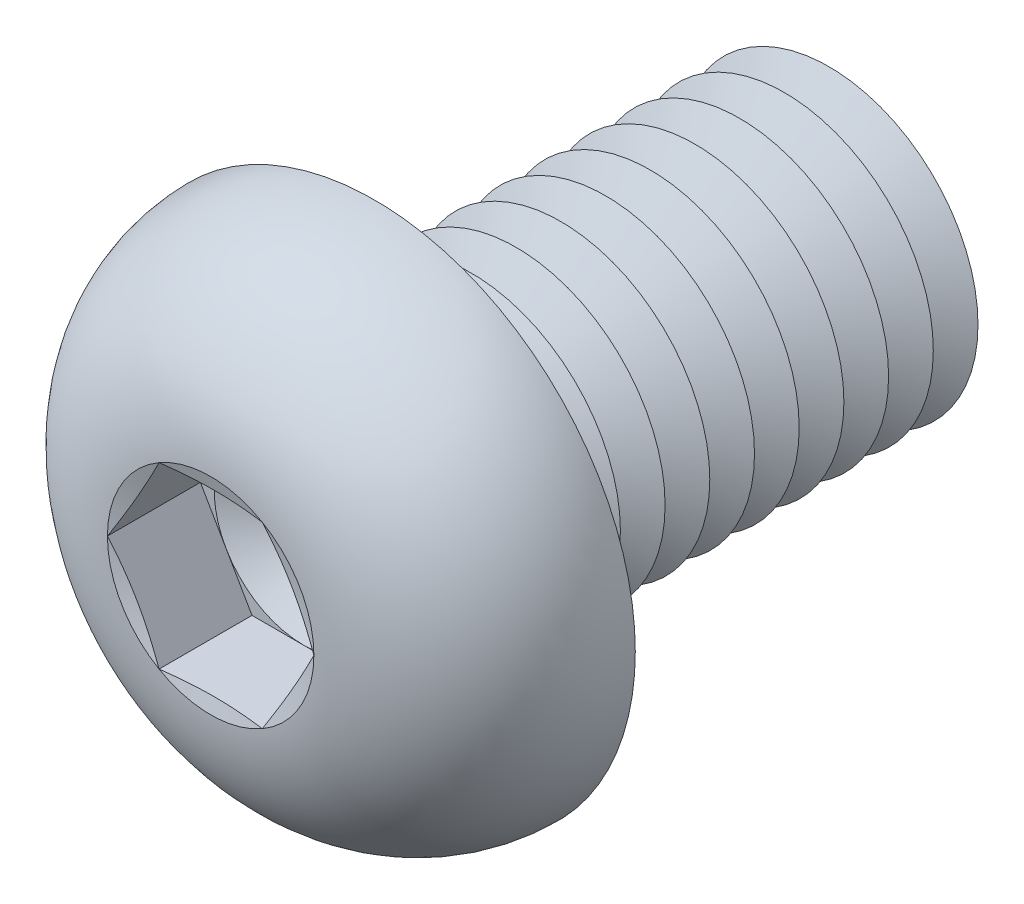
from build123d import *

# Parameters (mm, degrees)
FILLET1_R          = 0.75
LPATTERN1_COUNT    = 10
LPATTERN1_PITCH    = 1.5
CUT_EXTRUDE1_DEPTH = 3.12


with BuildPart() as part:
    # Sketch1 → Revolve1 (revolve)
    with BuildSketch(Plane(origin=(0, 0, 0), x_dir=(0, 0, -1), z_dir=(1, 0, 0)), mode=Mode.PRIVATE) as revolve1_sk:
        with BuildLine():
            Line((0, 5), (0, 8.75))
            ThreePointArc((0, 8.75), (-3.814142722, 7.21429474), (-5.5, 3.4641))
            Line((-5.5, 3.4641), (-5.035898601, 1.73205))
            Line((-5.035898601, 1.73205), (-5.5, 1.73205))
            Line((-5.5, 1.73205), (-5.5, 0))
            Line((-5.5, 0), (16, 0))
            Line((16, 0), (16, 5))
            Line((16, 5), (0, 5))
        make_face()
    revolve(revolve1_sk.sketch.rotate(Axis((0, 0, -16), (0, 0, 1)), 90), axis=Axis((0, 0, -16), (0, 0, 1)))

    # Fillet1
    fillet1_edges = [part.edges().sort_by_distance(p)[0] for p in [
        (5, 0, 0),
    ]]
    fillet(fillet1_edges, radius=FILLET1_R)

    # Sketch2 → Cut-Revolve1 (revolve, cut)
    with BuildSketch(Plane(origin=(0, 0, 0), x_dir=(0, 0, -1), z_dir=(1, 0, 0)), mode=Mode.PRIVATE) as cut_revolve1_sk:
        Polygon((15.25, 5), (16.75, 5), (16, 3.700961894), align=None)
    cut_revolve1 = revolve(cut_revolve1_sk.sketch.rotate(Axis((0, 0, -16), (0, 0, -1)), 270), axis=Axis((0, 0, -16), (0, 0, -1)), mode=Mode.SUBTRACT)

    # LPattern1: Cut-Revolve1 ×10
    with Locations(*[(0, 0, i * LPATTERN1_PITCH) for i in range(1, LPATTERN1_COUNT)]):
        add(cut_revolve1, mode=Mode.SUBTRACT)

    # Sketch3 → Cut-Extrude1 (cut)
    with BuildSketch(Plane.XY.offset(5.5)):
        Polygon((1.73205, 2.999998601), (-1.73205, 2.999998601), (-3.4641, 0), (-1.73205, -2.999998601), (1.73205, -2.999998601), (3.4641, 0), align=None)
    extrude(amount=-CUT_EXTRUDE1_DEPTH, mode=Mode.SUBTRACT)

    # Cut-Extrude2 cone 1 section (on through the dimple's axis) → Cut-Extrude2 (revolve, cut)
    with BuildSketch(Plane(origin=(0, 0, 2.38), x_dir=(0, -1, 0), z_dir=(1, 0, 0))):
        Polygon((0, 0), (2.999998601, 0), (0, 1.73205), align=None)
    revolve(axis=Axis((0, 0, 2.38), (0, 0, -1)), mode=Mode.SUBTRACT)


solid = part.part
